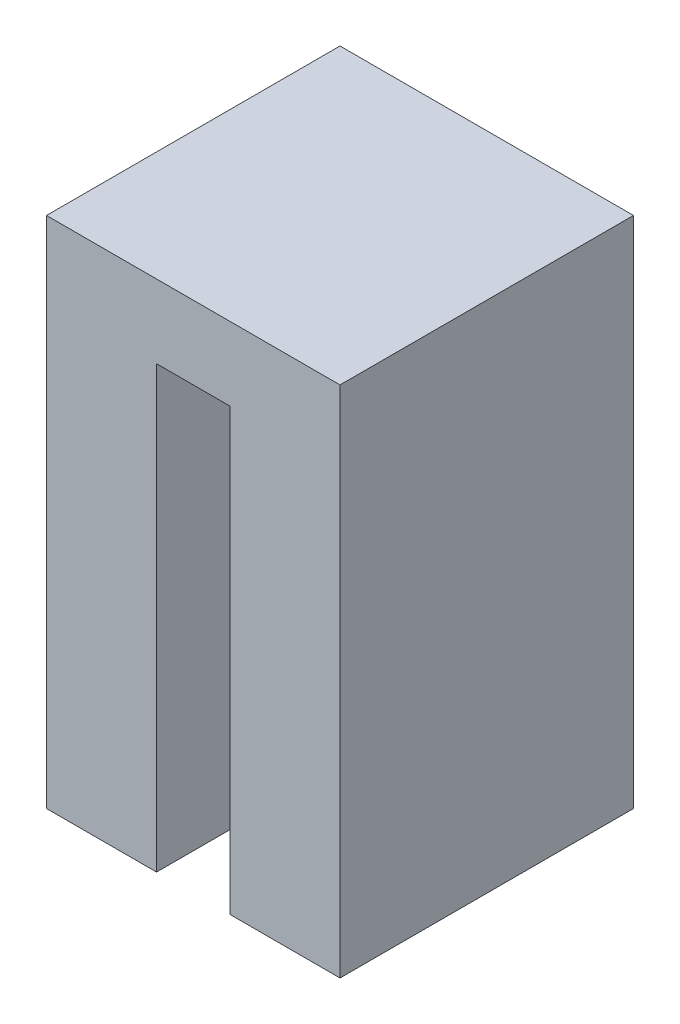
from build123d import *

# Parameters (mm, degrees)
BOSS_EXTRU_1_DEPTH = 200


with BuildPart() as part:
    # Esquisse1 → Boss.-Extru.1 (new body)
    with BuildSketch(Plane.XY):
        Polygon((-25, -300), (-100, -300), (-100, 50), (100, 50), (100, -300), (25, -300), (25, 0), (-25, 0), align=None)
    extrude(amount=-BOSS_EXTRU_1_DEPTH)


solid = part.part
